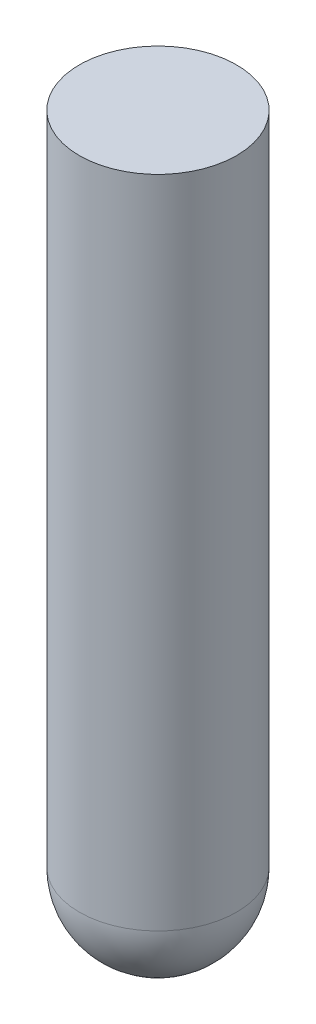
ISO-10303-21;
HEADER;
FILE_DESCRIPTION(('STEP AP214'),'2;1');
FILE_NAME('part.step','',(''),(''),'','','');
FILE_SCHEMA(('AUTOMOTIVE_DESIGN { 1 0 10303 214 1 1 1 1 }'));
ENDSEC;
DATA;
#1=APPLICATION_CONTEXT('core data for automotive mechanical design processes');
#2=APPLICATION_PROTOCOL_DEFINITION('international standard','automotive_design',2000,#1);
#3=PRODUCT_CONTEXT('',#1,'mechanical');
#4=PRODUCT('Part','Part','',(#3));
#5=PRODUCT_RELATED_PRODUCT_CATEGORY('part','',(#4));
#6=PRODUCT_DEFINITION_FORMATION('','',#4);
#7=PRODUCT_DEFINITION_CONTEXT('part definition',#1,'design');
#8=PRODUCT_DEFINITION('design','',#6,#7);
#9=PRODUCT_DEFINITION_SHAPE('','',#8);
#10=(LENGTH_UNIT() NAMED_UNIT(*) SI_UNIT(.MILLI.,.METRE.));
#11=(NAMED_UNIT(*) PLANE_ANGLE_UNIT() SI_UNIT($,.RADIAN.));
#12=(NAMED_UNIT(*) SI_UNIT($,.STERADIAN.) SOLID_ANGLE_UNIT());
#13=UNCERTAINTY_MEASURE_WITH_UNIT(LENGTH_MEASURE(1.E-05),#10,'distance_accuracy_value','');
#14=(GEOMETRIC_REPRESENTATION_CONTEXT(3) GLOBAL_UNCERTAINTY_ASSIGNED_CONTEXT((#13)) GLOBAL_UNIT_ASSIGNED_CONTEXT((#10,
#11,#12)) REPRESENTATION_CONTEXT('',''));
#15=CARTESIAN_POINT('',(0.,0.,0.));
#16=DIRECTION('',(0.,0.,1.));
#17=DIRECTION('',(1.,0.,0.));
#18=AXIS2_PLACEMENT_3D('',#15,#16,#17);
#19=CARTESIAN_POINT('',(41.79,165.17,0.));
#20=DIRECTION('',(0.,1.,0.));
#21=DIRECTION('',(-1.,0.,0.));
#22=AXIS2_PLACEMENT_3D('',#19,#20,#21);
#23=CYLINDRICAL_SURFACE('',#22,1.4925);
#24=CARTESIAN_POINT('',(41.79,166.6625,0.));
#25=DIRECTION('',(0.,1.,0.));
#26=DIRECTION('',(0.,0.,1.));
#27=AXIS2_PLACEMENT_3D('',#24,#25,#26);
#28=CIRCLE('',#27,1.4925);
#29=CARTESIAN_POINT('',(41.79,166.6625,1.4925));
#30=VERTEX_POINT('',#29);
#31=EDGE_CURVE('E10',#30,#30,#28,.T.);
#32=ORIENTED_EDGE('',*,*,#31,.T.);
#33=EDGE_LOOP('',(#32));
#34=FACE_BOUND('',#33,.T.);
#35=CARTESIAN_POINT('',(41.79,179.1,0.));
#36=DIRECTION('',(0.,-1.,0.));
#37=DIRECTION('',(1.,0.,0.));
#38=AXIS2_PLACEMENT_3D('',#35,#36,#37);
#39=CIRCLE('',#38,1.4925);
#40=CARTESIAN_POINT('',(43.2825,179.1,0.));
#41=VERTEX_POINT('',#40);
#42=EDGE_CURVE('E21',#41,#41,#39,.T.);
#43=ORIENTED_EDGE('',*,*,#42,.T.);
#44=EDGE_LOOP('',(#43));
#45=FACE_BOUND('',#44,.T.);
#46=ADVANCED_FACE('F14',(#34,#45),#23,.T.);
#47=CARTESIAN_POINT('',(41.79,179.1,0.));
#48=DIRECTION('',(0.,-1.,0.));
#49=DIRECTION('',(1.,0.,0.));
#50=AXIS2_PLACEMENT_3D('',#47,#48,#49);
#51=PLANE('',#50);
#52=ORIENTED_EDGE('',*,*,#42,.F.);
#53=EDGE_LOOP('',(#52));
#54=FACE_BOUND('',#53,.T.);
#55=ADVANCED_FACE('F47',(#54),#51,.F.);
#56=CARTESIAN_POINT('',(41.79,166.6625,0.));
#57=DIRECTION('',(0.,0.,1.));
#58=DIRECTION('',(1.,0.,0.));
#59=AXIS2_PLACEMENT_3D('',#56,#57,#58);
#60=SPHERICAL_SURFACE('',#59,1.4925);
#61=CARTESIAN_POINT('',(41.79,166.6625,0.));
#62=DIRECTION('',(0.,1.,0.));
#63=DIRECTION('',(0.,0.,1.));
#64=AXIS2_PLACEMENT_3D('',#61,#62,#63);
#65=SPHERICAL_SURFACE('',#64,1.4925);
#66=ORIENTED_EDGE('',*,*,#31,.F.);
#67=EDGE_LOOP('',(#66));
#68=FACE_BOUND('',#67,.T.);
#69=ADVANCED_FACE('F49',(#68),#65,.T.);
#70=CLOSED_SHELL('',(#46,#55,#69));
#71=MANIFOLD_SOLID_BREP('B1',#70);
#72=ADVANCED_BREP_SHAPE_REPRESENTATION('',(#18,#71),#14);
#73=SHAPE_DEFINITION_REPRESENTATION(#9,#72);
ENDSEC;
END-ISO-10303-21;
